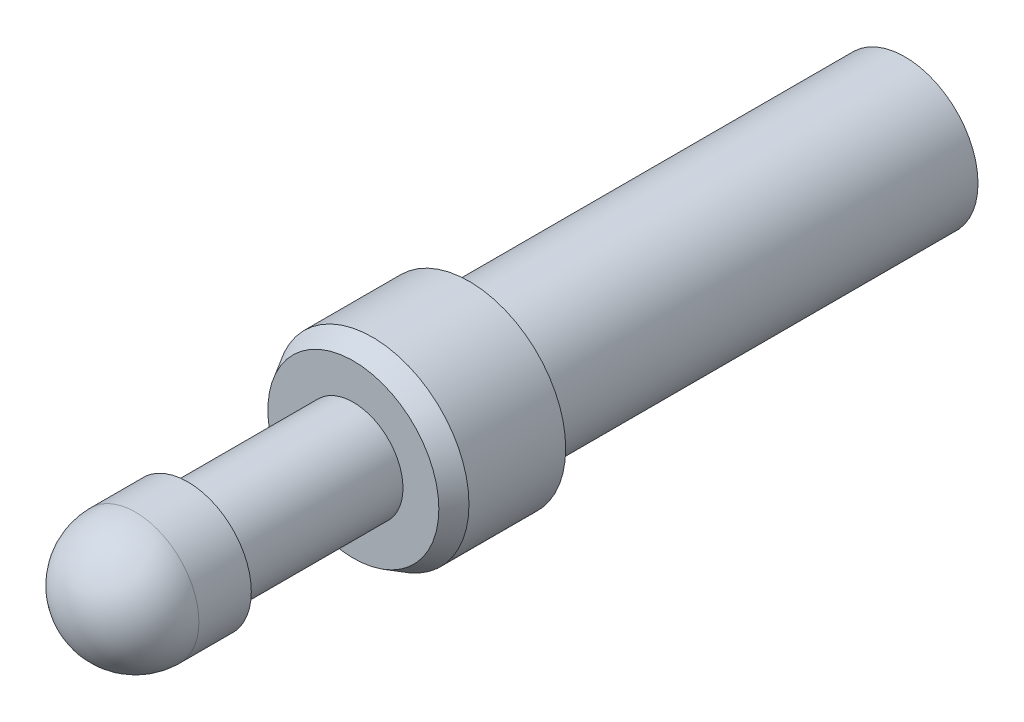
from build123d import *

# Parameters (mm, degrees)
ESQUISSE1_R      = 1.325
EXTRUSION1_DEPTH = 7.9
ESQUISSE2_R      = 1.75
EXTRUSION2_DEPTH = 2.1
ESQUISSE3_R      = 0.9
EXTRUSION3_DEPTH = 3
ESQUISSE4_R      = 1.15
EXTRUSION4_DEPTH = 2.1
CONG_1_R         = 1.15
CHANFREIN1_SIZE  = 0.2
CHANFREIN1_SIZE2 = 0.346410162


with BuildPart() as part:
    # Esquisse1 → Extrusion1 (new body)
    with BuildSketch(Plane.XY):
        Circle(ESQUISSE1_R)
    extrude(amount=EXTRUSION1_DEPTH)

    # Esquisse2 → Extrusion2 (add)
    with BuildSketch(Plane.XY.offset(7.9)):
        Circle(ESQUISSE2_R)
    extrude(amount=EXTRUSION2_DEPTH)

    # Esquisse3 → Extrusion3 (add)
    with BuildSketch(Plane.XY.offset(10)):
        Circle(ESQUISSE3_R)
    extrude(amount=EXTRUSION3_DEPTH)

    # Esquisse4 → Extrusion4 (add)
    with BuildSketch(Plane.XY.offset(13)):
        Circle(ESQUISSE4_R)
    extrude(amount=EXTRUSION4_DEPTH)

    # Cong_1
    cong_1_edges = [part.edges().sort_by_distance(p)[0] for p in [
        (-1.15, 0, 15.1),
    ]]
    fillet(cong_1_edges, radius=CONG_1_R)

    # Chanfrein1
    chanfrein1_edges = [part.edges().sort_by_distance(p)[0] for p in [
        (-1.75, 0, 10),
    ]]
    chanfrein1_side = [part.faces().sort_by_distance(p)[0] for p in [
        (-1.700502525, 0, 10),
    ]]
    chamfer(chanfrein1_edges, length=CHANFREIN1_SIZE, length2=CHANFREIN1_SIZE2, reference=chanfrein1_side[0])


solid = part.part
